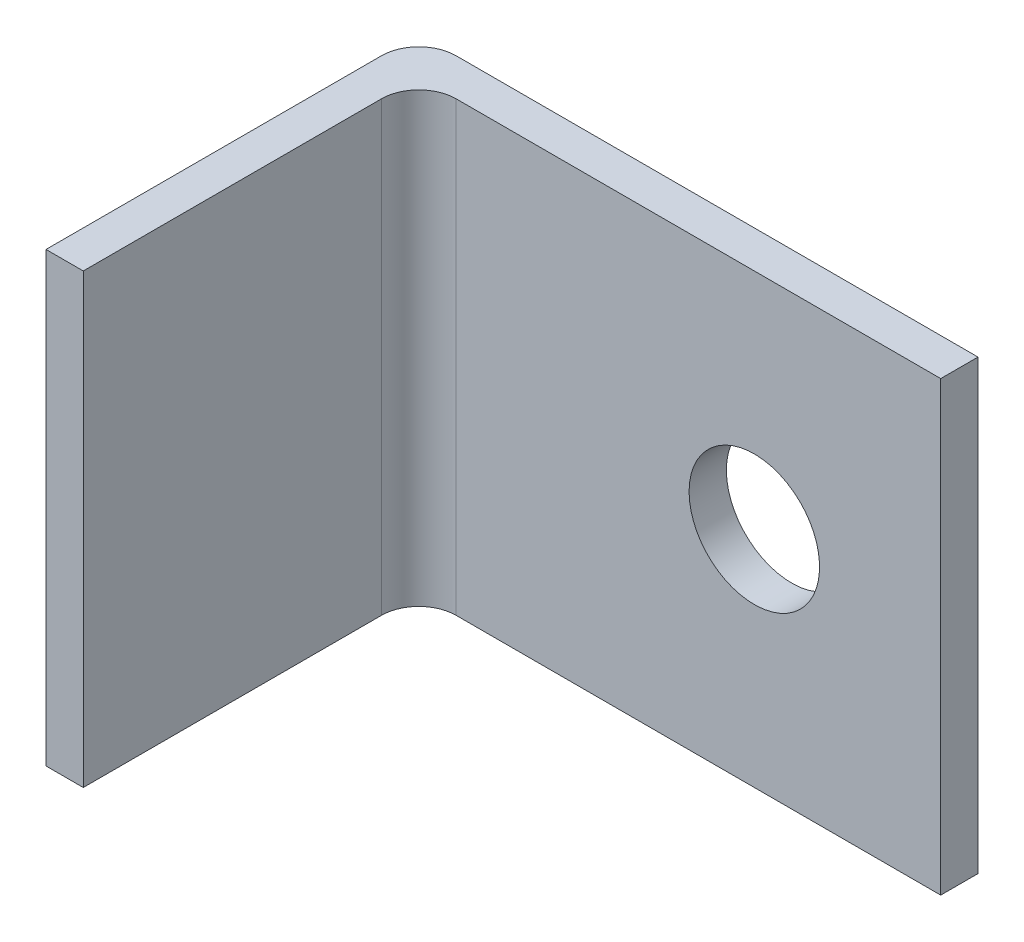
ISO-10303-21;
HEADER;
FILE_DESCRIPTION(('STEP AP214'),'2;1');
FILE_NAME('part.step','',(''),(''),'','','');
FILE_SCHEMA(('AUTOMOTIVE_DESIGN { 1 0 10303 214 1 1 1 1 }'));
ENDSEC;
DATA;
#1=APPLICATION_CONTEXT('core data for automotive mechanical design processes');
#2=APPLICATION_PROTOCOL_DEFINITION('international standard','automotive_design',2000,#1);
#3=PRODUCT_CONTEXT('',#1,'mechanical');
#4=PRODUCT('Part','Part','',(#3));
#5=PRODUCT_RELATED_PRODUCT_CATEGORY('part','',(#4));
#6=PRODUCT_DEFINITION_FORMATION('','',#4);
#7=PRODUCT_DEFINITION_CONTEXT('part definition',#1,'design');
#8=PRODUCT_DEFINITION('design','',#6,#7);
#9=PRODUCT_DEFINITION_SHAPE('','',#8);
#10=(LENGTH_UNIT() NAMED_UNIT(*) SI_UNIT(.MILLI.,.METRE.));
#11=(NAMED_UNIT(*) PLANE_ANGLE_UNIT() SI_UNIT($,.RADIAN.));
#12=(NAMED_UNIT(*) SI_UNIT($,.STERADIAN.) SOLID_ANGLE_UNIT());
#13=UNCERTAINTY_MEASURE_WITH_UNIT(LENGTH_MEASURE(1.E-05),#10,'distance_accuracy_value','');
#14=(GEOMETRIC_REPRESENTATION_CONTEXT(3) GLOBAL_UNCERTAINTY_ASSIGNED_CONTEXT((#13)) GLOBAL_UNIT_ASSIGNED_CONTEXT((#10,
#11,#12)) REPRESENTATION_CONTEXT('',''));
#15=CARTESIAN_POINT('',(0.,0.,0.));
#16=DIRECTION('',(0.,0.,1.));
#17=DIRECTION('',(1.,0.,0.));
#18=AXIS2_PLACEMENT_3D('',#15,#16,#17);
#19=CARTESIAN_POINT('',(0.,12.,0.));
#20=DIRECTION('',(0.,0.,-1.));
#21=DIRECTION('',(-1.,0.,0.));
#22=AXIS2_PLACEMENT_3D('',#19,#20,#21);
#23=PLANE('',#22);
#24=DIRECTION('',(1.,0.,0.));
#25=VECTOR('',#24,1.);
#26=CARTESIAN_POINT('',(0.,0.,0.));
#27=LINE('',#26,#25);
#28=CARTESIAN_POINT('',(0.,0.,0.));
#29=VERTEX_POINT('',#28);
#30=CARTESIAN_POINT('',(1.,0.,0.));
#31=VERTEX_POINT('',#30);
#32=EDGE_CURVE('E99',#29,#31,#27,.T.);
#33=ORIENTED_EDGE('',*,*,#32,.T.);
#34=DIRECTION('',(0.,-1.,0.));
#35=VECTOR('',#34,1.);
#36=CARTESIAN_POINT('',(1.,12.,0.));
#37=LINE('',#36,#35);
#38=CARTESIAN_POINT('',(1.,12.,0.));
#39=VERTEX_POINT('',#38);
#40=EDGE_CURVE('E103',#39,#31,#37,.T.);
#41=ORIENTED_EDGE('',*,*,#40,.F.);
#42=DIRECTION('',(1.,0.,0.));
#43=VECTOR('',#42,1.);
#44=CARTESIAN_POINT('',(0.,12.,0.));
#45=LINE('',#44,#43);
#46=CARTESIAN_POINT('',(0.,12.,0.));
#47=VERTEX_POINT('',#46);
#48=EDGE_CURVE('E130',#47,#39,#45,.T.);
#49=ORIENTED_EDGE('',*,*,#48,.F.);
#50=DIRECTION('',(0.,-1.,0.));
#51=VECTOR('',#50,1.);
#52=CARTESIAN_POINT('',(0.,12.,0.));
#53=LINE('',#52,#51);
#54=EDGE_CURVE('E114',#47,#29,#53,.T.);
#55=ORIENTED_EDGE('',*,*,#54,.T.);
#56=EDGE_LOOP('',(#33,#41,#49,#55));
#57=FACE_BOUND('',#56,.T.);
#58=ADVANCED_FACE('F34',(#57),#23,.F.);
#59=CARTESIAN_POINT('',(1.,12.,0.));
#60=DIRECTION('',(-1.,0.,0.));
#61=DIRECTION('',(0.,0.,1.));
#62=AXIS2_PLACEMENT_3D('',#59,#60,#61);
#63=PLANE('',#62);
#64=DIRECTION('',(0.,0.,-1.));
#65=VECTOR('',#64,1.);
#66=CARTESIAN_POINT('',(1.,0.,0.));
#67=LINE('',#66,#65);
#68=CARTESIAN_POINT('',(1.,0.,-8.));
#69=VERTEX_POINT('',#68);
#70=EDGE_CURVE('E94',#31,#69,#67,.T.);
#71=ORIENTED_EDGE('',*,*,#70,.T.);
#72=DIRECTION('',(0.,-1.,0.));
#73=VECTOR('',#72,1.);
#74=CARTESIAN_POINT('',(1.,12.,-8.));
#75=LINE('',#74,#73);
#76=CARTESIAN_POINT('',(1.,12.,-8.));
#77=VERTEX_POINT('',#76);
#78=EDGE_CURVE('E48',#69,#77,#75,.F.);
#79=ORIENTED_EDGE('',*,*,#78,.T.);
#80=DIRECTION('',(0.,0.,-1.));
#81=VECTOR('',#80,1.);
#82=CARTESIAN_POINT('',(1.,12.,0.));
#83=LINE('',#82,#81);
#84=EDGE_CURVE('E105',#39,#77,#83,.T.);
#85=ORIENTED_EDGE('',*,*,#84,.F.);
#86=ORIENTED_EDGE('',*,*,#40,.T.);
#87=EDGE_LOOP('',(#71,#79,#85,#86));
#88=FACE_BOUND('',#87,.T.);
#89=ADVANCED_FACE('F104',(#88),#63,.F.);
#90=CARTESIAN_POINT('',(1.,12.,-9.));
#91=DIRECTION('',(0.,0.,-1.));
#92=DIRECTION('',(-1.,0.,0.));
#93=AXIS2_PLACEMENT_3D('',#90,#91,#92);
#94=PLANE('',#93);
#95=CARTESIAN_POINT('',(10.,6.,-9.));
#96=DIRECTION('',(0.,0.,-1.));
#97=DIRECTION('',(-1.,0.,0.));
#98=AXIS2_PLACEMENT_3D('',#95,#96,#97);
#99=CIRCLE('',#98,1.75);
#100=CARTESIAN_POINT('',(8.25,6.,-9.));
#101=VERTEX_POINT('',#100);
#102=EDGE_CURVE('E115',#101,#101,#99,.T.);
#103=ORIENTED_EDGE('',*,*,#102,.T.);
#104=EDGE_LOOP('',(#103));
#105=FACE_BOUND('',#104,.T.);
#106=DIRECTION('',(1.,0.,0.));
#107=VECTOR('',#106,1.);
#108=CARTESIAN_POINT('',(1.,12.,-9.));
#109=LINE('',#108,#107);
#110=CARTESIAN_POINT('',(2.,12.,-9.));
#111=VERTEX_POINT('',#110);
#112=CARTESIAN_POINT('',(15.,12.,-9.));
#113=VERTEX_POINT('',#112);
#114=EDGE_CURVE('E133',#111,#113,#109,.T.);
#115=ORIENTED_EDGE('',*,*,#114,.F.);
#116=DIRECTION('',(0.,-1.,0.));
#117=VECTOR('',#116,1.);
#118=CARTESIAN_POINT('',(2.,0.,-9.));
#119=LINE('',#118,#117);
#120=CARTESIAN_POINT('',(2.,0.,-9.));
#121=VERTEX_POINT('',#120);
#122=EDGE_CURVE('E156',#111,#121,#119,.T.);
#123=ORIENTED_EDGE('',*,*,#122,.T.);
#124=DIRECTION('',(1.,0.,0.));
#125=VECTOR('',#124,1.);
#126=CARTESIAN_POINT('',(1.,0.,-9.));
#127=LINE('',#126,#125);
#128=CARTESIAN_POINT('',(15.,0.,-9.));
#129=VERTEX_POINT('',#128);
#130=EDGE_CURVE('E100',#121,#129,#127,.T.);
#131=ORIENTED_EDGE('',*,*,#130,.T.);
#132=DIRECTION('',(0.,-1.,0.));
#133=VECTOR('',#132,1.);
#134=CARTESIAN_POINT('',(15.,12.,-9.));
#135=LINE('',#134,#133);
#136=EDGE_CURVE('E110',#113,#129,#135,.T.);
#137=ORIENTED_EDGE('',*,*,#136,.F.);
#138=EDGE_LOOP('',(#115,#123,#131,#137));
#139=FACE_BOUND('',#138,.T.);
#140=ADVANCED_FACE('F162',(#105,#139),#94,.F.);
#141=CARTESIAN_POINT('',(15.,12.,-9.));
#142=DIRECTION('',(-1.,0.,0.));
#143=DIRECTION('',(0.,0.,1.));
#144=AXIS2_PLACEMENT_3D('',#141,#142,#143);
#145=PLANE('',#144);
#146=DIRECTION('',(0.,0.,-1.));
#147=VECTOR('',#146,1.);
#148=CARTESIAN_POINT('',(15.,0.,-9.));
#149=LINE('',#148,#147);
#150=CARTESIAN_POINT('',(15.,0.,-10.));
#151=VERTEX_POINT('',#150);
#152=EDGE_CURVE('E123',#129,#151,#149,.T.);
#153=ORIENTED_EDGE('',*,*,#152,.T.);
#154=DIRECTION('',(0.,-1.,0.));
#155=VECTOR('',#154,1.);
#156=CARTESIAN_POINT('',(15.,12.,-10.));
#157=LINE('',#156,#155);
#158=CARTESIAN_POINT('',(15.,12.,-10.));
#159=VERTEX_POINT('',#158);
#160=EDGE_CURVE('E143',#159,#151,#157,.T.);
#161=ORIENTED_EDGE('',*,*,#160,.F.);
#162=DIRECTION('',(0.,0.,-1.));
#163=VECTOR('',#162,1.);
#164=CARTESIAN_POINT('',(15.,12.,-9.));
#165=LINE('',#164,#163);
#166=EDGE_CURVE('E135',#113,#159,#165,.T.);
#167=ORIENTED_EDGE('',*,*,#166,.F.);
#168=ORIENTED_EDGE('',*,*,#136,.T.);
#169=EDGE_LOOP('',(#153,#161,#167,#168));
#170=FACE_BOUND('',#169,.T.);
#171=ADVANCED_FACE('F170',(#170),#145,.F.);
#172=CARTESIAN_POINT('',(0.,12.,-10.));
#173=DIRECTION('',(0.,0.,1.));
#174=DIRECTION('',(1.,0.,0.));
#175=AXIS2_PLACEMENT_3D('',#172,#173,#174);
#176=PLANE('',#175);
#177=CARTESIAN_POINT('',(10.,6.,-10.));
#178=DIRECTION('',(0.,0.,-1.));
#179=DIRECTION('',(-1.,0.,0.));
#180=AXIS2_PLACEMENT_3D('',#177,#178,#179);
#181=CIRCLE('',#180,1.75);
#182=CARTESIAN_POINT('',(8.25,6.,-10.));
#183=VERTEX_POINT('',#182);
#184=EDGE_CURVE('E118',#183,#183,#181,.T.);
#185=ORIENTED_EDGE('',*,*,#184,.F.);
#186=EDGE_LOOP('',(#185));
#187=FACE_BOUND('',#186,.T.);
#188=DIRECTION('',(-1.,0.,0.));
#189=VECTOR('',#188,1.);
#190=CARTESIAN_POINT('',(0.,0.,-10.));
#191=LINE('',#190,#189);
#192=CARTESIAN_POINT('',(1.,0.,-10.));
#193=VERTEX_POINT('',#192);
#194=EDGE_CURVE('E125',#151,#193,#191,.T.);
#195=ORIENTED_EDGE('',*,*,#194,.T.);
#196=DIRECTION('',(0.,-1.,0.));
#197=VECTOR('',#196,1.);
#198=CARTESIAN_POINT('',(1.,12.,-10.));
#199=LINE('',#198,#197);
#200=CARTESIAN_POINT('',(1.,12.,-10.));
#201=VERTEX_POINT('',#200);
#202=EDGE_CURVE('E152',#193,#201,#199,.F.);
#203=ORIENTED_EDGE('',*,*,#202,.T.);
#204=DIRECTION('',(-1.,0.,0.));
#205=VECTOR('',#204,1.);
#206=CARTESIAN_POINT('',(0.,12.,-10.));
#207=LINE('',#206,#205);
#208=EDGE_CURVE('E137',#159,#201,#207,.T.);
#209=ORIENTED_EDGE('',*,*,#208,.F.);
#210=ORIENTED_EDGE('',*,*,#160,.T.);
#211=EDGE_LOOP('',(#195,#203,#209,#210));
#212=FACE_BOUND('',#211,.T.);
#213=ADVANCED_FACE('F174',(#187,#212),#176,.F.);
#214=CARTESIAN_POINT('',(0.,12.,0.));
#215=DIRECTION('',(1.,0.,0.));
#216=DIRECTION('',(0.,0.,-1.));
#217=AXIS2_PLACEMENT_3D('',#214,#215,#216);
#218=PLANE('',#217);
#219=DIRECTION('',(0.,0.,1.));
#220=VECTOR('',#219,1.);
#221=CARTESIAN_POINT('',(0.,12.,0.));
#222=LINE('',#221,#220);
#223=CARTESIAN_POINT('',(0.,12.,-9.));
#224=VERTEX_POINT('',#223);
#225=EDGE_CURVE('E140',#224,#47,#222,.T.);
#226=ORIENTED_EDGE('',*,*,#225,.F.);
#227=DIRECTION('',(0.,-1.,0.));
#228=VECTOR('',#227,1.);
#229=CARTESIAN_POINT('',(0.,12.,-9.));
#230=LINE('',#229,#228);
#231=CARTESIAN_POINT('',(0.,0.,-9.));
#232=VERTEX_POINT('',#231);
#233=EDGE_CURVE('E109',#224,#232,#230,.T.);
#234=ORIENTED_EDGE('',*,*,#233,.T.);
#235=DIRECTION('',(0.,0.,1.));
#236=VECTOR('',#235,1.);
#237=CARTESIAN_POINT('',(0.,0.,0.));
#238=LINE('',#237,#236);
#239=EDGE_CURVE('E128',#232,#29,#238,.T.);
#240=ORIENTED_EDGE('',*,*,#239,.T.);
#241=ORIENTED_EDGE('',*,*,#54,.F.);
#242=EDGE_LOOP('',(#226,#234,#240,#241));
#243=FACE_BOUND('',#242,.T.);
#244=ADVANCED_FACE('F184',(#243),#218,.F.);
#245=CARTESIAN_POINT('',(1.,12.,0.));
#246=DIRECTION('',(0.,1.,0.));
#247=DIRECTION('',(0.,0.,1.));
#248=AXIS2_PLACEMENT_3D('',#245,#246,#247);
#249=PLANE('',#248);
#250=ORIENTED_EDGE('',*,*,#208,.T.);
#251=CARTESIAN_POINT('',(1.,12.,-9.));
#252=DIRECTION('',(0.,1.,0.));
#253=DIRECTION('',(0.,0.,1.));
#254=AXIS2_PLACEMENT_3D('',#251,#252,#253);
#255=CIRCLE('',#254,1.);
#256=EDGE_CURVE('E154',#201,#224,#255,.T.);
#257=ORIENTED_EDGE('',*,*,#256,.T.);
#258=ORIENTED_EDGE('',*,*,#225,.T.);
#259=ORIENTED_EDGE('',*,*,#48,.T.);
#260=ORIENTED_EDGE('',*,*,#84,.T.);
#261=CARTESIAN_POINT('',(2.,12.,-8.));
#262=DIRECTION('',(0.,1.,0.));
#263=DIRECTION('',(0.,0.,1.));
#264=AXIS2_PLACEMENT_3D('',#261,#262,#263);
#265=CIRCLE('',#264,1.);
#266=EDGE_CURVE('E11',#77,#111,#265,.F.);
#267=ORIENTED_EDGE('',*,*,#266,.T.);
#268=ORIENTED_EDGE('',*,*,#114,.T.);
#269=ORIENTED_EDGE('',*,*,#166,.T.);
#270=EDGE_LOOP('',(#250,#257,#258,#259,#260,#267,#268,#269));
#271=FACE_BOUND('',#270,.T.);
#272=ADVANCED_FACE('F178',(#271),#249,.T.);
#273=CARTESIAN_POINT('',(1.,0.,0.));
#274=DIRECTION('',(0.,1.,0.));
#275=DIRECTION('',(0.,0.,1.));
#276=AXIS2_PLACEMENT_3D('',#273,#274,#275);
#277=PLANE('',#276);
#278=ORIENTED_EDGE('',*,*,#239,.F.);
#279=CARTESIAN_POINT('',(1.,0.,-9.));
#280=DIRECTION('',(0.,1.,0.));
#281=DIRECTION('',(0.,0.,1.));
#282=AXIS2_PLACEMENT_3D('',#279,#280,#281);
#283=CIRCLE('',#282,1.);
#284=EDGE_CURVE('E150',#232,#193,#283,.F.);
#285=ORIENTED_EDGE('',*,*,#284,.T.);
#286=ORIENTED_EDGE('',*,*,#194,.F.);
#287=ORIENTED_EDGE('',*,*,#152,.F.);
#288=ORIENTED_EDGE('',*,*,#130,.F.);
#289=CARTESIAN_POINT('',(2.,0.,-8.));
#290=DIRECTION('',(0.,1.,0.));
#291=DIRECTION('',(0.,0.,1.));
#292=AXIS2_PLACEMENT_3D('',#289,#290,#291);
#293=CIRCLE('',#292,1.);
#294=EDGE_CURVE('E41',#121,#69,#293,.T.);
#295=ORIENTED_EDGE('',*,*,#294,.T.);
#296=ORIENTED_EDGE('',*,*,#70,.F.);
#297=ORIENTED_EDGE('',*,*,#32,.F.);
#298=EDGE_LOOP('',(#278,#285,#286,#287,#288,#295,#296,#297));
#299=FACE_BOUND('',#298,.T.);
#300=ADVANCED_FACE('F97',(#299),#277,.F.);
#301=CARTESIAN_POINT('',(10.,6.,2.));
#302=DIRECTION('',(0.,0.,-1.));
#303=DIRECTION('',(-1.,0.,0.));
#304=AXIS2_PLACEMENT_3D('',#301,#302,#303);
#305=CYLINDRICAL_SURFACE('',#304,1.75);
#306=ORIENTED_EDGE('',*,*,#184,.T.);
#307=EDGE_LOOP('',(#306));
#308=FACE_BOUND('',#307,.T.);
#309=ORIENTED_EDGE('',*,*,#102,.F.);
#310=EDGE_LOOP('',(#309));
#311=FACE_BOUND('',#310,.T.);
#312=ADVANCED_FACE('F191',(#308,#311),#305,.F.);
#313=CARTESIAN_POINT('',(1.,12.,-9.));
#314=DIRECTION('',(0.,-1.,0.));
#315=DIRECTION('',(0.,0.,-1.));
#316=AXIS2_PLACEMENT_3D('',#313,#314,#315);
#317=CYLINDRICAL_SURFACE('',#316,1.);
#318=ORIENTED_EDGE('',*,*,#256,.F.);
#319=ORIENTED_EDGE('',*,*,#202,.F.);
#320=ORIENTED_EDGE('',*,*,#284,.F.);
#321=ORIENTED_EDGE('',*,*,#233,.F.);
#322=EDGE_LOOP('',(#318,#319,#320,#321));
#323=FACE_BOUND('',#322,.T.);
#324=ADVANCED_FACE('F182',(#323),#317,.T.);
#325=CARTESIAN_POINT('',(2.,12.,-8.));
#326=DIRECTION('',(0.,1.,0.));
#327=DIRECTION('',(0.,0.,1.));
#328=AXIS2_PLACEMENT_3D('',#325,#326,#327);
#329=CYLINDRICAL_SURFACE('',#328,1.);
#330=ORIENTED_EDGE('',*,*,#266,.F.);
#331=ORIENTED_EDGE('',*,*,#78,.F.);
#332=ORIENTED_EDGE('',*,*,#294,.F.);
#333=ORIENTED_EDGE('',*,*,#122,.F.);
#334=EDGE_LOOP('',(#330,#331,#332,#333));
#335=FACE_BOUND('',#334,.T.);
#336=ADVANCED_FACE('F185',(#335),#329,.F.);
#337=CLOSED_SHELL('',(#58,#89,#140,#171,#213,#244,#272,#300,#312,#324,#336));
#338=MANIFOLD_SOLID_BREP('B2',#337);
#339=ADVANCED_BREP_SHAPE_REPRESENTATION('',(#18,#338),#14);
#340=SHAPE_DEFINITION_REPRESENTATION(#9,#339);
ENDSEC;
END-ISO-10303-21;
